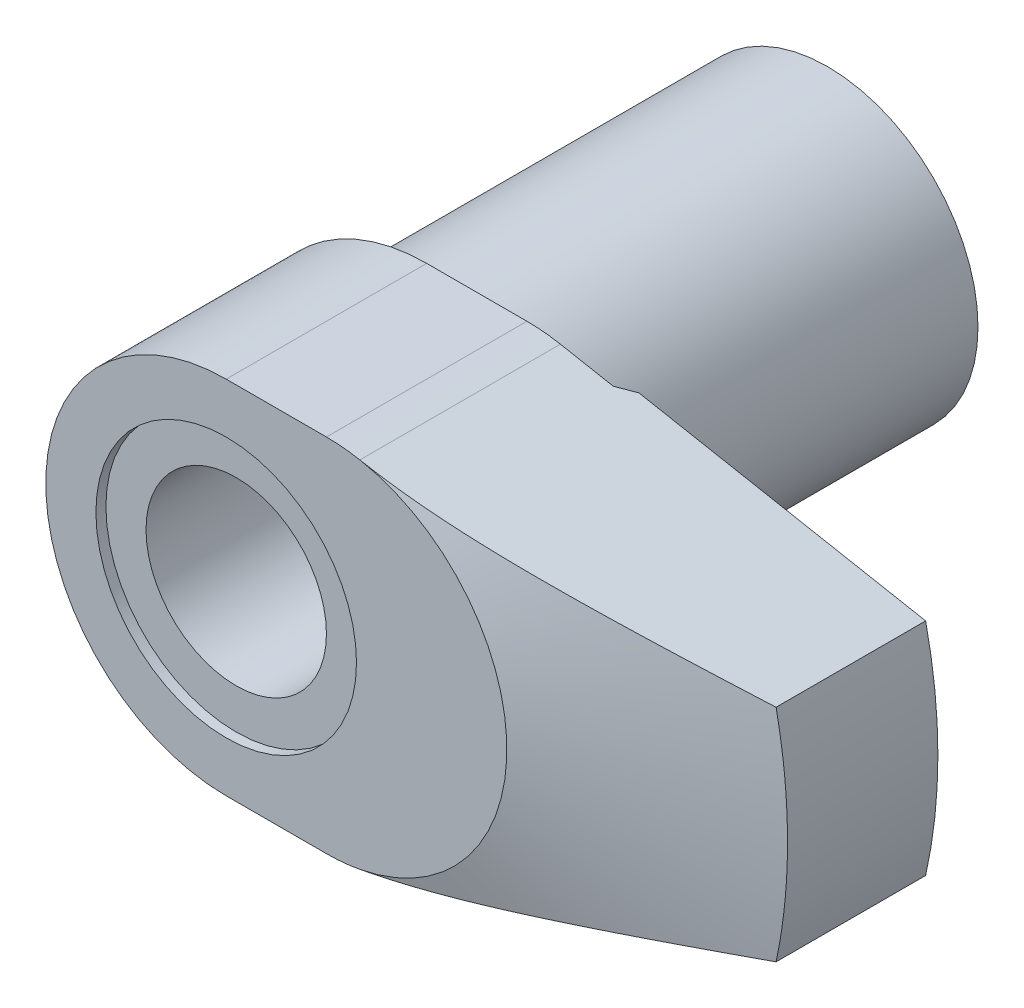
ISO-10303-21;
HEADER;
FILE_DESCRIPTION(('STEP AP214'),'2;1');
FILE_NAME('part.step','',(''),(''),'','','');
FILE_SCHEMA(('AUTOMOTIVE_DESIGN { 1 0 10303 214 1 1 1 1 }'));
ENDSEC;
DATA;
#1=APPLICATION_CONTEXT('core data for automotive mechanical design processes');
#2=APPLICATION_PROTOCOL_DEFINITION('international standard','automotive_design',2000,#1);
#3=PRODUCT_CONTEXT('',#1,'mechanical');
#4=PRODUCT('Part','Part','',(#3));
#5=PRODUCT_RELATED_PRODUCT_CATEGORY('part','',(#4));
#6=PRODUCT_DEFINITION_FORMATION('','',#4);
#7=PRODUCT_DEFINITION_CONTEXT('part definition',#1,'design');
#8=PRODUCT_DEFINITION('design','',#6,#7);
#9=PRODUCT_DEFINITION_SHAPE('','',#8);
#10=(LENGTH_UNIT() NAMED_UNIT(*) SI_UNIT(.MILLI.,.METRE.));
#11=(NAMED_UNIT(*) PLANE_ANGLE_UNIT() SI_UNIT($,.RADIAN.));
#12=(NAMED_UNIT(*) SI_UNIT($,.STERADIAN.) SOLID_ANGLE_UNIT());
#13=UNCERTAINTY_MEASURE_WITH_UNIT(LENGTH_MEASURE(1.E-05),#10,'distance_accuracy_value','');
#14=(GEOMETRIC_REPRESENTATION_CONTEXT(3) GLOBAL_UNCERTAINTY_ASSIGNED_CONTEXT((#13)) GLOBAL_UNIT_ASSIGNED_CONTEXT((#10,
#11,#12)) REPRESENTATION_CONTEXT('',''));
#15=CARTESIAN_POINT('',(0.,0.,0.));
#16=DIRECTION('',(0.,0.,1.));
#17=DIRECTION('',(1.,0.,0.));
#18=AXIS2_PLACEMENT_3D('',#15,#16,#17);
#19=CARTESIAN_POINT('',(10.,0.,39.));
#20=DIRECTION('',(0.,0.,1.));
#21=DIRECTION('',(1.,0.,0.));
#22=AXIS2_PLACEMENT_3D('',#19,#20,#21);
#23=CYLINDRICAL_SURFACE('',#22,18.);
#24=DIRECTION('',(0.,0.,1.));
#25=VECTOR('',#24,1.);
#26=CARTESIAN_POINT('',(10.,-18.,39.));
#27=LINE('',#26,#25);
#28=CARTESIAN_POINT('',(10.,-18.,40.));
#29=VERTEX_POINT('',#28);
#30=CARTESIAN_POINT('',(10.,-18.,60.));
#31=VERTEX_POINT('',#30);
#32=EDGE_CURVE('E143',#29,#31,#27,.T.);
#33=ORIENTED_EDGE('',*,*,#32,.F.);
#34=CARTESIAN_POINT('',(10.,0.,40.));
#35=DIRECTION('',(0.,0.,-1.));
#36=DIRECTION('',(-1.,0.,0.));
#37=AXIS2_PLACEMENT_3D('',#34,#35,#36);
#38=CIRCLE('',#37,18.);
#39=CARTESIAN_POINT('',(13.3380934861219,-17.6877678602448,40.));
#40=VERTEX_POINT('',#39);
#41=EDGE_CURVE('E120',#40,#29,#38,.T.);
#42=ORIENTED_EDGE('',*,*,#41,.F.);
#43=DIRECTION('',(0.,0.,1.));
#44=VECTOR('',#43,1.);
#45=CARTESIAN_POINT('',(13.3380934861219,-17.6877678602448,39.));
#46=LINE('',#45,#44);
#47=CARTESIAN_POINT('',(13.3380934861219,-17.6877678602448,60.));
#48=VERTEX_POINT('',#47);
#49=EDGE_CURVE('E110',#40,#48,#46,.T.);
#50=ORIENTED_EDGE('',*,*,#49,.T.);
#51=CARTESIAN_POINT('',(10.,0.,60.));
#52=DIRECTION('',(0.,0.,1.));
#53=DIRECTION('',(1.,0.,0.));
#54=AXIS2_PLACEMENT_3D('',#51,#52,#53);
#55=CIRCLE('',#54,18.);
#56=EDGE_CURVE('E118',#31,#48,#55,.T.);
#57=ORIENTED_EDGE('',*,*,#56,.F.);
#58=EDGE_LOOP('',(#33,#42,#50,#57));
#59=FACE_BOUND('',#58,.T.);
#60=ADVANCED_FACE('F14',(#59),#23,.T.);
#61=CARTESIAN_POINT('',(1.88540101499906E-13,-18.,39.));
#62=DIRECTION('',(0.,-1.,0.));
#63=DIRECTION('',(1.,0.,0.));
#64=AXIS2_PLACEMENT_3D('',#61,#62,#63);
#65=PLANE('',#64);
#66=DIRECTION('',(0.,0.,1.));
#67=VECTOR('',#66,1.);
#68=CARTESIAN_POINT('',(1.88540101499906E-13,-18.,39.));
#69=LINE('',#68,#67);
#70=CARTESIAN_POINT('',(0.,-18.,40.));
#71=VERTEX_POINT('',#70);
#72=CARTESIAN_POINT('',(0.,-18.,60.));
#73=VERTEX_POINT('',#72);
#74=EDGE_CURVE('E146',#71,#73,#69,.T.);
#75=ORIENTED_EDGE('',*,*,#74,.F.);
#76=DIRECTION('',(-1.,0.,0.));
#77=VECTOR('',#76,1.);
#78=CARTESIAN_POINT('',(10.,-18.,40.));
#79=LINE('',#78,#77);
#80=EDGE_CURVE('E233',#29,#71,#79,.T.);
#81=ORIENTED_EDGE('',*,*,#80,.F.);
#82=ORIENTED_EDGE('',*,*,#32,.T.);
#83=DIRECTION('',(1.,0.,0.));
#84=VECTOR('',#83,1.);
#85=CARTESIAN_POINT('',(1.88540101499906E-13,-18.,60.));
#86=LINE('',#85,#84);
#87=EDGE_CURVE('E127',#73,#31,#86,.T.);
#88=ORIENTED_EDGE('',*,*,#87,.F.);
#89=EDGE_LOOP('',(#75,#81,#82,#88));
#90=FACE_BOUND('',#89,.T.);
#91=ADVANCED_FACE('F267',(#90),#65,.T.);
#92=CARTESIAN_POINT('',(10.,18.,39.));
#93=DIRECTION('',(0.,1.,0.));
#94=DIRECTION('',(-1.,0.,0.));
#95=AXIS2_PLACEMENT_3D('',#92,#93,#94);
#96=PLANE('',#95);
#97=DIRECTION('',(0.,0.,1.));
#98=VECTOR('',#97,1.);
#99=CARTESIAN_POINT('',(10.,18.,39.));
#100=LINE('',#99,#98);
#101=CARTESIAN_POINT('',(10.,18.,40.));
#102=VERTEX_POINT('',#101);
#103=CARTESIAN_POINT('',(10.,18.,60.));
#104=VERTEX_POINT('',#103);
#105=EDGE_CURVE('E150',#102,#104,#100,.T.);
#106=ORIENTED_EDGE('',*,*,#105,.F.);
#107=DIRECTION('',(1.,0.,0.));
#108=VECTOR('',#107,1.);
#109=CARTESIAN_POINT('',(0.,18.,40.));
#110=LINE('',#109,#108);
#111=CARTESIAN_POINT('',(0.,18.,40.));
#112=VERTEX_POINT('',#111);
#113=EDGE_CURVE('E235',#112,#102,#110,.T.);
#114=ORIENTED_EDGE('',*,*,#113,.F.);
#115=DIRECTION('',(0.,0.,1.));
#116=VECTOR('',#115,1.);
#117=CARTESIAN_POINT('',(0.,18.,39.));
#118=LINE('',#117,#116);
#119=CARTESIAN_POINT('',(0.,18.,60.));
#120=VERTEX_POINT('',#119);
#121=EDGE_CURVE('E148',#112,#120,#118,.T.);
#122=ORIENTED_EDGE('',*,*,#121,.T.);
#123=DIRECTION('',(-1.,0.,0.));
#124=VECTOR('',#123,1.);
#125=CARTESIAN_POINT('',(10.,18.,60.));
#126=LINE('',#125,#124);
#127=EDGE_CURVE('E131',#104,#120,#126,.T.);
#128=ORIENTED_EDGE('',*,*,#127,.F.);
#129=EDGE_LOOP('',(#106,#114,#122,#128));
#130=FACE_BOUND('',#129,.T.);
#131=ADVANCED_FACE('F272',(#130),#96,.T.);
#132=CARTESIAN_POINT('',(10.,0.,39.));
#133=DIRECTION('',(0.,0.,1.));
#134=DIRECTION('',(1.,0.,0.));
#135=AXIS2_PLACEMENT_3D('',#132,#133,#134);
#136=CYLINDRICAL_SURFACE('',#135,18.);
#137=DIRECTION('',(0.,0.,1.));
#138=VECTOR('',#137,1.);
#139=CARTESIAN_POINT('',(13.3380934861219,17.6877678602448,39.));
#140=LINE('',#139,#138);
#141=CARTESIAN_POINT('',(13.3380934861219,17.6877678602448,40.));
#142=VERTEX_POINT('',#141);
#143=CARTESIAN_POINT('',(13.3380934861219,17.6877678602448,60.));
#144=VERTEX_POINT('',#143);
#145=EDGE_CURVE('E152',#142,#144,#140,.T.);
#146=ORIENTED_EDGE('',*,*,#145,.F.);
#147=CARTESIAN_POINT('',(10.,0.,40.));
#148=DIRECTION('',(0.,0.,-1.));
#149=DIRECTION('',(-1.,0.,0.));
#150=AXIS2_PLACEMENT_3D('',#147,#148,#149);
#151=CIRCLE('',#150,18.);
#152=EDGE_CURVE('E222',#102,#142,#151,.T.);
#153=ORIENTED_EDGE('',*,*,#152,.F.);
#154=ORIENTED_EDGE('',*,*,#105,.T.);
#155=CARTESIAN_POINT('',(10.,0.,60.));
#156=DIRECTION('',(0.,0.,1.));
#157=DIRECTION('',(1.,0.,0.));
#158=AXIS2_PLACEMENT_3D('',#155,#156,#157);
#159=CIRCLE('',#158,18.);
#160=EDGE_CURVE('E128',#144,#104,#159,.T.);
#161=ORIENTED_EDGE('',*,*,#160,.F.);
#162=EDGE_LOOP('',(#146,#153,#154,#161));
#163=FACE_BOUND('',#162,.T.);
#164=ADVANCED_FACE('F210',(#163),#136,.T.);
#165=CARTESIAN_POINT('',(48.7749935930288,11.,39.));
#166=DIRECTION('',(0.185449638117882,0.982653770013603,0.));
#167=DIRECTION('',(-0.982653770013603,0.185449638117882,0.));
#168=AXIS2_PLACEMENT_3D('',#165,#166,#167);
#169=PLANE('',#168);
#170=CARTESIAN_POINT('',(48.7751935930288,10.9999622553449,53.9167444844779));
#171=CARTESIAN_POINT('',(48.0465361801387,11.1374768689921,54.0976756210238));
#172=CARTESIAN_POINT('',(47.3176316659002,11.2750381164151,54.2775823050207));
#173=CARTESIAN_POINT('',(45.8592364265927,11.5502712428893,54.6349399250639));
#174=CARTESIAN_POINT('',(45.1297456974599,11.6879431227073,54.8123908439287));
#175=CARTESIAN_POINT('',(43.670157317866,11.9634014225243,55.1644128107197));
#176=CARTESIAN_POINT('',(42.9400597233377,12.1011878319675,55.3389840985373));
#177=CARTESIAN_POINT('',(41.4790904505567,12.3769067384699,55.6847383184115));
#178=CARTESIAN_POINT('',(40.7482187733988,12.5148392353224,55.855921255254));
#179=CARTESIAN_POINT('',(39.2877585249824,12.7904620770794,56.1937556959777));
#180=CARTESIAN_POINT('',(38.5581726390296,12.9281519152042,56.3604192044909));
#181=CARTESIAN_POINT('',(37.0979614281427,13.2037277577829,56.6889595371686));
#182=CARTESIAN_POINT('',(36.3673361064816,13.3416137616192,56.8508363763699));
#183=CARTESIAN_POINT('',(34.9047280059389,13.6176419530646,57.1688639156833));
#184=CARTESIAN_POINT('',(34.1727449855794,13.7557841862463,57.3250134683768));
#185=CARTESIAN_POINT('',(32.70737170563,14.0323342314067,57.630345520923));
#186=CARTESIAN_POINT('',(31.9739814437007,14.1707420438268,57.7795280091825));
#187=CARTESIAN_POINT('',(30.5028244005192,14.4483836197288,58.0699756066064));
#188=CARTESIAN_POINT('',(29.7650515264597,14.5876185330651,58.2112088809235));
#189=CARTESIAN_POINT('',(28.2876513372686,14.8664383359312,58.4832933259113));
#190=CARTESIAN_POINT('',(27.5480240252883,15.0060232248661,58.614144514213));
#191=CARTESIAN_POINT('',(26.0670755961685,15.2855126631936,58.8631596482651));
#192=CARTESIAN_POINT('',(25.3257555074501,15.4254170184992,58.9813298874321));
#193=CARTESIAN_POINT('',(23.8408933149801,15.7056450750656,59.2024316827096));
#194=CARTESIAN_POINT('',(23.0973511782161,15.8459687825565,59.3053630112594));
#195=CARTESIAN_POINT('',(21.6057597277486,16.1274668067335,59.4933400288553));
#196=CARTESIAN_POINT('',(20.8577035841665,16.2686424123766,59.5783300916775));
#197=CARTESIAN_POINT('',(19.3595596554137,16.551377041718,59.7269620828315));
#198=CARTESIAN_POINT('',(18.6094720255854,16.6929360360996,59.7906055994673));
#199=CARTESIAN_POINT('',(17.4824925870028,16.9056232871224,59.8680607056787));
#200=CARTESIAN_POINT('',(17.1061863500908,16.9766410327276,59.8908897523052));
#201=CARTESIAN_POINT('',(16.3532535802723,17.1187369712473,59.9302421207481));
#202=CARTESIAN_POINT('',(15.9766270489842,17.1898151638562,59.9467654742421));
#203=CARTESIAN_POINT('',(15.223044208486,17.3320337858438,59.9732922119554));
#204=CARTESIAN_POINT('',(14.8460878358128,17.4031742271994,59.9832937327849));
#205=CARTESIAN_POINT('',(14.0920528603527,17.5454781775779,59.9966560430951));
#206=CARTESIAN_POINT('',(13.7149742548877,17.6166416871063,60.0000166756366));
#207=CARTESIAN_POINT('',(13.3378934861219,17.6878056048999,59.9999999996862));
#208=B_SPLINE_CURVE_WITH_KNOTS('',3,(#170,#171,#172,#173,#174,#175,#176,#177,#178,#179,#180,
#181,#182,#183,#184,#185,#186,#187,#188,#189,#190,#191,#192,#193,#194,#195,#196,#197,#198,#199,
#200,#201,#202,#203,#204,#205,#206,#207),.UNSPECIFIED.,.F.,.F.,(4,2,2,2,2,2,2,2,2,2,2,2,2,2,2,2,
2,2,4),(0.,2.28982495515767,4.57966592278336,6.86931515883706,9.15896116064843,11.4417702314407,
13.7245721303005,16.0078289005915,18.2910894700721,20.5829240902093,22.874754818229,
25.165442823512,27.456165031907,29.7538884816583,32.0514409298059,33.2022839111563,
34.3531211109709,35.5042869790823,36.6554800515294),.UNSPECIFIED.);
#209=CARTESIAN_POINT('',(48.7749935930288,11.,53.9167941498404));
#210=VERTEX_POINT('',#209);
#211=EDGE_CURVE('E98',#210,#144,#208,.T.);
#212=ORIENTED_EDGE('',*,*,#211,.F.);
#213=DIRECTION('',(0.,0.,1.));
#214=VECTOR('',#213,1.);
#215=CARTESIAN_POINT('',(48.7749935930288,11.,39.));
#216=LINE('',#215,#214);
#217=CARTESIAN_POINT('',(48.7749935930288,11.,39.));
#218=VERTEX_POINT('',#217);
#219=EDGE_CURVE('E154',#218,#210,#216,.T.);
#220=ORIENTED_EDGE('',*,*,#219,.F.);
#221=DIRECTION('',(-0.982653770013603,0.185449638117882,0.));
#222=VECTOR('',#221,1.);
#223=CARTESIAN_POINT('',(48.7749935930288,11.,39.));
#224=LINE('',#223,#222);
#225=CARTESIAN_POINT('',(20.1776893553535,16.3969769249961,39.));
#226=VERTEX_POINT('',#225);
#227=EDGE_CURVE('E121',#218,#226,#224,.T.);
#228=ORIENTED_EDGE('',*,*,#227,.T.);
#229=CARTESIAN_POINT('',(18.6102300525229,16.692792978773,40.0002));
#230=CARTESIAN_POINT('',(18.742019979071,16.6679211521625,39.9187004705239));
#231=CARTESIAN_POINT('',(18.873513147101,16.6431053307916,39.8367046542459));
#232=CARTESIAN_POINT('',(19.135917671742,16.5935834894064,39.6717681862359));
#233=CARTESIAN_POINT('',(19.266829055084,16.5688774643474,39.588827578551));
#234=CARTESIAN_POINT('',(19.5280935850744,16.5195707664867,39.4220419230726));
#235=CARTESIAN_POINT('',(19.658446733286,16.49497009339,39.338196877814));
#236=CARTESIAN_POINT('',(19.9186184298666,16.4458696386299,39.1696385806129));
#237=CARTESIAN_POINT('',(20.0484369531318,16.4213698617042,39.0849252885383));
#238=CARTESIAN_POINT('',(20.1779937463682,16.3969194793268,38.9998));
#239=B_SPLINE_CURVE_WITH_KNOTS('',3,(#229,#230,#231,#232,#233,#234,#235,#236,#237,#238),
.UNSPECIFIED.,.F.,.F.,(4,2,2,2,4),(0.,0.470810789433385,0.941599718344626,1.41238732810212,
1.88319679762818),.UNSPECIFIED.);
#240=CARTESIAN_POINT('',(18.6105534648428,16.6927319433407,40.));
#241=VERTEX_POINT('',#240);
#242=EDGE_CURVE('E196',#241,#226,#239,.T.);
#243=ORIENTED_EDGE('',*,*,#242,.F.);
#244=DIRECTION('',(0.982653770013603,-0.185449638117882,0.));
#245=VECTOR('',#244,1.);
#246=CARTESIAN_POINT('',(13.3380934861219,17.6877678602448,40.));
#247=LINE('',#246,#245);
#248=EDGE_CURVE('E228',#142,#241,#247,.T.);
#249=ORIENTED_EDGE('',*,*,#248,.F.);
#250=ORIENTED_EDGE('',*,*,#145,.T.);
#251=EDGE_LOOP('',(#212,#220,#228,#243,#249,#250));
#252=FACE_BOUND('',#251,.T.);
#253=ADVANCED_FACE('F206',(#252),#169,.T.);
#254=CARTESIAN_POINT('',(48.7749935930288,-11.,39.));
#255=DIRECTION('',(0.185449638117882,-0.982653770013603,0.));
#256=DIRECTION('',(0.982653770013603,0.185449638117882,0.));
#257=AXIS2_PLACEMENT_3D('',#254,#255,#256);
#258=PLANE('',#257);
#259=CARTESIAN_POINT('',(13.3378934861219,-17.6878056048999,59.9999999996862));
#260=CARTESIAN_POINT('',(13.7171760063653,-17.6162261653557,60.0000170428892));
#261=CARTESIAN_POINT('',(14.0964563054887,-17.5446471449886,59.9966168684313));
#262=CARTESIAN_POINT('',(14.8548924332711,-17.401512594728,59.9830983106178));
#263=CARTESIAN_POINT('',(15.2340482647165,-17.3299570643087,59.9729800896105));
#264=CARTESIAN_POINT('',(15.9920234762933,-17.1869094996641,59.9461455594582));
#265=CARTESIAN_POINT('',(16.3708429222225,-17.1154174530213,59.9294311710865));
#266=CARTESIAN_POINT('',(17.1281561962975,-16.9724948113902,59.8896272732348));
#267=CARTESIAN_POINT('',(17.5066500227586,-16.9010642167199,59.8665377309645));
#268=CARTESIAN_POINT('',(18.6401621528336,-16.6871440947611,59.7882077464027));
#269=CARTESIAN_POINT('',(19.3945854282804,-16.5447668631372,59.7238553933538));
#270=CARTESIAN_POINT('',(20.9013719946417,-16.2604011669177,59.5736091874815));
#271=CARTESIAN_POINT('',(21.6537351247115,-16.1184127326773,59.4877136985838));
#272=CARTESIAN_POINT('',(23.1538953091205,-15.8352975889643,59.2977882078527));
#273=CARTESIAN_POINT('',(23.9016992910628,-15.6941695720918,59.1938143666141));
#274=CARTESIAN_POINT('',(25.3950618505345,-15.4123372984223,58.9705329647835));
#275=CARTESIAN_POINT('',(26.1406204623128,-15.2716330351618,58.8512256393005));
#276=CARTESIAN_POINT('',(27.6300337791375,-14.9905460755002,58.5998747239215));
#277=CARTESIAN_POINT('',(28.3738874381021,-14.8501635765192,58.4678247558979));
#278=CARTESIAN_POINT('',(29.8597278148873,-14.5697509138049,58.1933062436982));
#279=CARTESIAN_POINT('',(30.601714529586,-14.4297207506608,58.0508376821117));
#280=CARTESIAN_POINT('',(32.0727292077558,-14.1521060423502,57.7595953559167));
#281=CARTESIAN_POINT('',(32.801782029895,-14.0145168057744,57.6109511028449));
#282=CARTESIAN_POINT('',(34.2585048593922,-13.7395993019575,57.3068302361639));
#283=CARTESIAN_POINT('',(34.9861748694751,-13.6022710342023,57.1513536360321));
#284=CARTESIAN_POINT('',(36.4401757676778,-13.327867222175,56.8347765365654));
#285=CARTESIAN_POINT('',(37.1665068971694,-13.1907916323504,56.6736771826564));
#286=CARTESIAN_POINT('',(38.6181463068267,-12.9168334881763,56.3467724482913));
#287=CARTESIAN_POINT('',(39.3434545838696,-12.7799509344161,56.1809670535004));
#288=CARTESIAN_POINT('',(40.7953350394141,-12.5059472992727,55.844920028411));
#289=CARTESIAN_POINT('',(41.5219046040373,-12.3688267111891,55.674666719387));
#290=CARTESIAN_POINT('',(42.9742806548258,-12.0947295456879,55.3308212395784));
#291=CARTESIAN_POINT('',(43.7000871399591,-11.957752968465,55.1572290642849));
#292=CARTESIAN_POINT('',(45.1511071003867,-11.6839117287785,54.807202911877));
#293=CARTESIAN_POINT('',(45.876320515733,-11.5470470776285,54.6307686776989));
#294=CARTESIAN_POINT('',(47.3261685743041,-11.2734270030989,54.2754753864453));
#295=CARTESIAN_POINT('',(48.0508032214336,-11.1366715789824,54.0966163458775));
#296=CARTESIAN_POINT('',(48.7751935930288,-10.9999622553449,53.9167444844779));
#297=B_SPLINE_CURVE_WITH_KNOTS('',3,(#259,#260,#261,#262,#263,#264,#265,#266,#267,#268,#269,
#270,#271,#272,#273,#274,#275,#276,#277,#278,#279,#280,#281,#282,#283,#284,#285,#286,#287,#288,
#289,#290,#291,#292,#293,#294,#295,#296),.UNSPECIFIED.,.F.,.F.,(4,2,2,2,2,2,2,2,2,2,2,2,2,2,2,2,
2,2,4),(0.,1.15791456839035,2.31580115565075,3.47335082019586,4.63090643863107,6.94182118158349,
9.25291147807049,11.5569465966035,13.8609463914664,16.1661054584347,18.4712683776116,
20.7412290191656,23.0111851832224,25.280681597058,27.5501849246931,29.8264061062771,
32.1026303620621,34.3790616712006,36.6554774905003),.UNSPECIFIED.);
#298=CARTESIAN_POINT('',(48.7749935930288,-11.,53.9167941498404));
#299=VERTEX_POINT('',#298);
#300=EDGE_CURVE('E34',#48,#299,#297,.T.);
#301=ORIENTED_EDGE('',*,*,#300,.F.);
#302=ORIENTED_EDGE('',*,*,#49,.F.);
#303=DIRECTION('',(-0.982653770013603,-0.185449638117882,0.));
#304=VECTOR('',#303,1.);
#305=CARTESIAN_POINT('',(18.6105534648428,-16.6927319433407,40.));
#306=LINE('',#305,#304);
#307=CARTESIAN_POINT('',(18.6105534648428,-16.6927319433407,40.));
#308=VERTEX_POINT('',#307);
#309=EDGE_CURVE('E230',#308,#40,#306,.T.);
#310=ORIENTED_EDGE('',*,*,#309,.F.);
#311=CARTESIAN_POINT('',(20.1779937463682,-16.3969194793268,38.9998));
#312=CARTESIAN_POINT('',(20.0484369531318,-16.4213698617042,39.0849252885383));
#313=CARTESIAN_POINT('',(19.9186184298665,-16.4458696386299,39.1696385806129));
#314=CARTESIAN_POINT('',(19.658446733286,-16.49497009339,39.338196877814));
#315=CARTESIAN_POINT('',(19.5280935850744,-16.5195707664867,39.4220419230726));
#316=CARTESIAN_POINT('',(19.266829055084,-16.5688774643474,39.588827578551));
#317=CARTESIAN_POINT('',(19.135917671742,-16.5935834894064,39.6717681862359));
#318=CARTESIAN_POINT('',(18.873513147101,-16.6431053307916,39.8367046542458));
#319=CARTESIAN_POINT('',(18.742019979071,-16.6679211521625,39.9187004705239));
#320=CARTESIAN_POINT('',(18.6102300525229,-16.692792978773,40.0002));
#321=B_SPLINE_CURVE_WITH_KNOTS('',3,(#311,#312,#313,#314,#315,#316,#317,#318,#319,#320),
.UNSPECIFIED.,.F.,.F.,(4,2,2,2,4),(0.,0.470809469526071,0.941597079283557,1.4123860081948,
1.88319679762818),.UNSPECIFIED.);
#322=CARTESIAN_POINT('',(20.1776893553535,-16.3969769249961,39.));
#323=VERTEX_POINT('',#322);
#324=EDGE_CURVE('E28',#323,#308,#321,.T.);
#325=ORIENTED_EDGE('',*,*,#324,.F.);
#326=DIRECTION('',(0.982653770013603,0.185449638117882,0.));
#327=VECTOR('',#326,1.);
#328=CARTESIAN_POINT('',(48.7749935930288,-11.,39.));
#329=LINE('',#328,#327);
#330=CARTESIAN_POINT('',(48.7749935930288,-11.,39.));
#331=VERTEX_POINT('',#330);
#332=EDGE_CURVE('E142',#323,#331,#329,.T.);
#333=ORIENTED_EDGE('',*,*,#332,.T.);
#334=DIRECTION('',(0.,0.,1.));
#335=VECTOR('',#334,1.);
#336=CARTESIAN_POINT('',(48.7749935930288,-11.,39.));
#337=LINE('',#336,#335);
#338=EDGE_CURVE('E112',#331,#299,#337,.T.);
#339=ORIENTED_EDGE('',*,*,#338,.T.);
#340=EDGE_LOOP('',(#301,#302,#310,#325,#333,#339));
#341=FACE_BOUND('',#340,.T.);
#342=ADVANCED_FACE('F108',(#341),#258,.T.);
#343=CARTESIAN_POINT('',(0.,0.,60.));
#344=DIRECTION('',(0.,0.,-1.));
#345=DIRECTION('',(-1.,0.,0.));
#346=AXIS2_PLACEMENT_3D('',#343,#344,#345);
#347=CYLINDRICAL_SURFACE('',#346,18.);
#348=CARTESIAN_POINT('',(0.,0.,40.));
#349=DIRECTION('',(0.,0.,1.));
#350=DIRECTION('',(1.,0.,0.));
#351=AXIS2_PLACEMENT_3D('',#348,#349,#350);
#352=CIRCLE('',#351,18.);
#353=EDGE_CURVE('E134',#112,#71,#352,.T.);
#354=ORIENTED_EDGE('',*,*,#353,.T.);
#355=ORIENTED_EDGE('',*,*,#74,.T.);
#356=CARTESIAN_POINT('',(0.,0.,60.));
#357=DIRECTION('',(0.,0.,1.));
#358=DIRECTION('',(1.,0.,0.));
#359=AXIS2_PLACEMENT_3D('',#356,#357,#358);
#360=CIRCLE('',#359,18.);
#361=EDGE_CURVE('E176',#120,#73,#360,.T.);
#362=ORIENTED_EDGE('',*,*,#361,.F.);
#363=ORIENTED_EDGE('',*,*,#121,.F.);
#364=EDGE_LOOP('',(#354,#355,#362,#363));
#365=FACE_BOUND('',#364,.T.);
#366=ADVANCED_FACE('F16',(#365),#347,.T.);
#367=CARTESIAN_POINT('',(60.,20.,39.));
#368=DIRECTION('',(0.,0.,1.));
#369=DIRECTION('',(1.,0.,0.));
#370=AXIS2_PLACEMENT_3D('',#367,#368,#369);
#371=PLANE('',#370);
#372=ORIENTED_EDGE('',*,*,#332,.F.);
#373=CARTESIAN_POINT('',(0.,0.,39.));
#374=DIRECTION('',(0.,0.,1.));
#375=DIRECTION('',(1.,0.,0.));
#376=AXIS2_PLACEMENT_3D('',#373,#374,#375);
#377=CIRCLE('',#376,26.);
#378=EDGE_CURVE('E42',#323,#226,#377,.T.);
#379=ORIENTED_EDGE('',*,*,#378,.T.);
#380=ORIENTED_EDGE('',*,*,#227,.F.);
#381=CARTESIAN_POINT('',(0.,0.,39.));
#382=DIRECTION('',(0.,0.,1.));
#383=DIRECTION('',(1.,0.,0.));
#384=AXIS2_PLACEMENT_3D('',#381,#382,#383);
#385=CIRCLE('',#384,50.);
#386=EDGE_CURVE('E247',#331,#218,#385,.T.);
#387=ORIENTED_EDGE('',*,*,#386,.F.);
#388=EDGE_LOOP('',(#372,#379,#380,#387));
#389=FACE_BOUND('',#388,.T.);
#390=ADVANCED_FACE('F250',(#389),#371,.F.);
#391=CARTESIAN_POINT('',(0.,0.,0.));
#392=DIRECTION('',(0.,0.,-1.));
#393=DIRECTION('',(-1.,0.,0.));
#394=AXIS2_PLACEMENT_3D('',#391,#392,#393);
#395=CYLINDRICAL_SURFACE('',#394,9.);
#396=CARTESIAN_POINT('',(0.,0.,34.));
#397=DIRECTION('',(0.,0.,-1.));
#398=DIRECTION('',(-1.,0.,0.));
#399=AXIS2_PLACEMENT_3D('',#396,#397,#398);
#400=CIRCLE('',#399,9.);
#401=CARTESIAN_POINT('',(-9.,0.,34.));
#402=VERTEX_POINT('',#401);
#403=EDGE_CURVE('E170',#402,#402,#400,.T.);
#404=ORIENTED_EDGE('',*,*,#403,.T.);
#405=EDGE_LOOP('',(#404));
#406=FACE_BOUND('',#405,.T.);
#407=CARTESIAN_POINT('',(0.,0.,59.));
#408=DIRECTION('',(0.,0.,1.));
#409=DIRECTION('',(1.,0.,0.));
#410=AXIS2_PLACEMENT_3D('',#407,#408,#409);
#411=CIRCLE('',#410,9.);
#412=CARTESIAN_POINT('',(9.,0.,59.));
#413=VERTEX_POINT('',#412);
#414=EDGE_CURVE('E161',#413,#413,#411,.T.);
#415=ORIENTED_EDGE('',*,*,#414,.T.);
#416=EDGE_LOOP('',(#415));
#417=FACE_BOUND('',#416,.T.);
#418=ADVANCED_FACE('F252',(#406,#417),#395,.F.);
#419=CARTESIAN_POINT('',(0.,0.,0.));
#420=DIRECTION('',(0.,0.,1.));
#421=DIRECTION('',(1.,0.,0.));
#422=AXIS2_PLACEMENT_3D('',#419,#420,#421);
#423=PLANE('',#422);
#424=CARTESIAN_POINT('',(0.,0.,0.));
#425=DIRECTION('',(0.,0.,-1.));
#426=DIRECTION('',(-1.,0.,0.));
#427=AXIS2_PLACEMENT_3D('',#424,#425,#426);
#428=CIRCLE('',#427,15.);
#429=CARTESIAN_POINT('',(-15.,0.,0.));
#430=VERTEX_POINT('',#429);
#431=EDGE_CURVE('E173',#430,#430,#428,.T.);
#432=ORIENTED_EDGE('',*,*,#431,.T.);
#433=EDGE_LOOP('',(#432));
#434=FACE_BOUND('',#433,.T.);
#435=CARTESIAN_POINT('',(0.,0.,0.));
#436=DIRECTION('',(0.,0.,-1.));
#437=DIRECTION('',(-1.,0.,0.));
#438=AXIS2_PLACEMENT_3D('',#435,#436,#437);
#439=CIRCLE('',#438,11.5);
#440=CARTESIAN_POINT('',(-11.5,0.,0.));
#441=VERTEX_POINT('',#440);
#442=EDGE_CURVE('E164',#441,#441,#439,.T.);
#443=ORIENTED_EDGE('',*,*,#442,.F.);
#444=EDGE_LOOP('',(#443));
#445=FACE_BOUND('',#444,.T.);
#446=ADVANCED_FACE('F260',(#434,#445),#423,.F.);
#447=CARTESIAN_POINT('',(0.,0.,60.));
#448=DIRECTION('',(0.,0.,1.));
#449=DIRECTION('',(1.,0.,0.));
#450=AXIS2_PLACEMENT_3D('',#447,#448,#449);
#451=PLANE('',#450);
#452=CARTESIAN_POINT('',(10.,0.,60.));
#453=DIRECTION('',(0.,0.,1.));
#454=DIRECTION('',(1.,0.,0.));
#455=AXIS2_PLACEMENT_3D('',#452,#453,#454);
#456=CIRCLE('',#455,18.);
#457=EDGE_CURVE('E95',#48,#144,#456,.T.);
#458=ORIENTED_EDGE('',*,*,#457,.T.);
#459=ORIENTED_EDGE('',*,*,#160,.T.);
#460=ORIENTED_EDGE('',*,*,#127,.T.);
#461=ORIENTED_EDGE('',*,*,#361,.T.);
#462=ORIENTED_EDGE('',*,*,#87,.T.);
#463=ORIENTED_EDGE('',*,*,#56,.T.);
#464=EDGE_LOOP('',(#458,#459,#460,#461,#462,#463));
#465=FACE_BOUND('',#464,.T.);
#466=CARTESIAN_POINT('',(0.,0.,60.));
#467=DIRECTION('',(0.,0.,1.));
#468=DIRECTION('',(1.,0.,0.));
#469=AXIS2_PLACEMENT_3D('',#466,#467,#468);
#470=CIRCLE('',#469,13.);
#471=CARTESIAN_POINT('',(13.,0.,60.));
#472=VERTEX_POINT('',#471);
#473=EDGE_CURVE('E145',#472,#472,#470,.T.);
#474=ORIENTED_EDGE('',*,*,#473,.F.);
#475=EDGE_LOOP('',(#474));
#476=FACE_BOUND('',#475,.T.);
#477=ADVANCED_FACE('F123',(#465,#476),#451,.T.);
#478=CARTESIAN_POINT('',(0.,0.,39.));
#479=DIRECTION('',(0.,0.,-1.));
#480=DIRECTION('',(-1.,0.,0.));
#481=AXIS2_PLACEMENT_3D('',#478,#479,#480);
#482=CYLINDRICAL_SURFACE('',#481,15.);
#483=ORIENTED_EDGE('',*,*,#431,.F.);
#484=EDGE_LOOP('',(#483));
#485=FACE_BOUND('',#484,.T.);
#486=CARTESIAN_POINT('',(0.,0.,40.));
#487=DIRECTION('',(0.,0.,1.));
#488=DIRECTION('',(1.,0.,0.));
#489=AXIS2_PLACEMENT_3D('',#486,#487,#488);
#490=CIRCLE('',#489,15.);
#491=CARTESIAN_POINT('',(15.,0.,40.));
#492=VERTEX_POINT('',#491);
#493=EDGE_CURVE('E129',#492,#492,#490,.T.);
#494=ORIENTED_EDGE('',*,*,#493,.F.);
#495=EDGE_LOOP('',(#494));
#496=FACE_BOUND('',#495,.T.);
#497=ADVANCED_FACE('F289',(#485,#496),#482,.T.);
#498=CARTESIAN_POINT('',(9.,0.,34.));
#499=DIRECTION('',(0.,0.,-1.));
#500=DIRECTION('',(-1.,0.,0.));
#501=AXIS2_PLACEMENT_3D('',#498,#499,#500);
#502=PLANE('',#501);
#503=CARTESIAN_POINT('',(0.,0.,34.));
#504=DIRECTION('',(0.,0.,-1.));
#505=DIRECTION('',(-1.,0.,0.));
#506=AXIS2_PLACEMENT_3D('',#503,#504,#505);
#507=CIRCLE('',#506,11.5);
#508=CARTESIAN_POINT('',(-11.5,0.,34.));
#509=VERTEX_POINT('',#508);
#510=EDGE_CURVE('E167',#509,#509,#507,.T.);
#511=ORIENTED_EDGE('',*,*,#510,.T.);
#512=EDGE_LOOP('',(#511));
#513=FACE_BOUND('',#512,.T.);
#514=ORIENTED_EDGE('',*,*,#403,.F.);
#515=EDGE_LOOP('',(#514));
#516=FACE_BOUND('',#515,.T.);
#517=ADVANCED_FACE('F286',(#513,#516),#502,.T.);
#518=CARTESIAN_POINT('',(0.,0.,0.));
#519=DIRECTION('',(0.,0.,-1.));
#520=DIRECTION('',(-1.,0.,0.));
#521=AXIS2_PLACEMENT_3D('',#518,#519,#520);
#522=CYLINDRICAL_SURFACE('',#521,11.5);
#523=ORIENTED_EDGE('',*,*,#442,.T.);
#524=EDGE_LOOP('',(#523));
#525=FACE_BOUND('',#524,.T.);
#526=ORIENTED_EDGE('',*,*,#510,.F.);
#527=EDGE_LOOP('',(#526));
#528=FACE_BOUND('',#527,.T.);
#529=ADVANCED_FACE('F282',(#525,#528),#522,.F.);
#530=CARTESIAN_POINT('',(0.,0.,59.));
#531=DIRECTION('',(0.,0.,1.));
#532=DIRECTION('',(1.,0.,0.));
#533=AXIS2_PLACEMENT_3D('',#530,#531,#532);
#534=CYLINDRICAL_SURFACE('',#533,13.);
#535=CARTESIAN_POINT('',(0.,0.,59.));
#536=DIRECTION('',(0.,0.,1.));
#537=DIRECTION('',(1.,0.,0.));
#538=AXIS2_PLACEMENT_3D('',#535,#536,#537);
#539=CIRCLE('',#538,13.);
#540=CARTESIAN_POINT('',(13.,0.,59.));
#541=VERTEX_POINT('',#540);
#542=EDGE_CURVE('E158',#541,#541,#539,.T.);
#543=ORIENTED_EDGE('',*,*,#542,.F.);
#544=EDGE_LOOP('',(#543));
#545=FACE_BOUND('',#544,.T.);
#546=ORIENTED_EDGE('',*,*,#473,.T.);
#547=EDGE_LOOP('',(#546));
#548=FACE_BOUND('',#547,.T.);
#549=ADVANCED_FACE('F278',(#545,#548),#534,.F.);
#550=CARTESIAN_POINT('',(0.,0.,59.));
#551=DIRECTION('',(0.,0.,1.));
#552=DIRECTION('',(1.,0.,0.));
#553=AXIS2_PLACEMENT_3D('',#550,#551,#552);
#554=PLANE('',#553);
#555=ORIENTED_EDGE('',*,*,#414,.F.);
#556=EDGE_LOOP('',(#555));
#557=FACE_BOUND('',#556,.T.);
#558=ORIENTED_EDGE('',*,*,#542,.T.);
#559=EDGE_LOOP('',(#558));
#560=FACE_BOUND('',#559,.T.);
#561=ADVANCED_FACE('F275',(#557,#560),#554,.T.);
#562=CARTESIAN_POINT('',(0.,0.,39.));
#563=DIRECTION('',(0.,0.,1.));
#564=DIRECTION('',(1.,0.,0.));
#565=AXIS2_PLACEMENT_3D('',#562,#563,#564);
#566=CYLINDRICAL_SURFACE('',#565,50.);
#567=CARTESIAN_POINT('',(48.7749484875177,-11.0002,53.9167910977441));
#568=CARTESIAN_POINT('',(48.9306309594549,-10.3099440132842,53.9273259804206));
#569=CARTESIAN_POINT('',(49.0716452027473,-9.6163707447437,53.9368824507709));
#570=CARTESIAN_POINT('',(49.324122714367,-8.22383261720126,53.9540108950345));
#571=CARTESIAN_POINT('',(49.4355856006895,-7.52486768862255,53.9615828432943));
#572=CARTESIAN_POINT('',(49.62878932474,-6.12246248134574,53.9747175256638));
#573=CARTESIAN_POINT('',(49.7105155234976,-5.41902017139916,53.9802792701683));
#574=CARTESIAN_POINT('',(49.8440224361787,-4.00933979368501,53.9893694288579));
#575=CARTESIAN_POINT('',(49.8958036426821,-3.3031017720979,53.9928978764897));
#576=CARTESIAN_POINT('',(50.0047161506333,-1.20802801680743,54.0003201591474));
#577=CARTESIAN_POINT('',(50.0189880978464,0.183269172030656,54.0012942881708));
#578=CARTESIAN_POINT('',(49.9315541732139,2.961424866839,53.9953338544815));
#579=CARTESIAN_POINT('',(49.8299183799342,4.34828554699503,53.9884040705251));
#580=CARTESIAN_POINT('',(49.6198783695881,6.16973049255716,53.9741128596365));
#581=CARTESIAN_POINT('',(49.5630560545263,6.61068793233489,53.9702481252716));
#582=CARTESIAN_POINT('',(49.4376820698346,7.49086697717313,53.9617264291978));
#583=CARTESIAN_POINT('',(49.3691325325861,7.9300888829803,53.9570696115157));
#584=CARTESIAN_POINT('',(49.2199027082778,8.80915057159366,53.9469394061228));
#585=CARTESIAN_POINT('',(49.1391524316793,9.24897838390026,53.9414613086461));
#586=CARTESIAN_POINT('',(48.9658705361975,10.1263788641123,53.929716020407));
#587=CARTESIAN_POINT('',(48.8733367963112,10.5639511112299,53.9234486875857));
#588=CARTESIAN_POINT('',(48.7749484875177,11.0002,53.9167910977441));
#589=B_SPLINE_CURVE_WITH_KNOTS('',3,(#567,#568,#569,#570,#571,#572,#573,#574,#575,#576,#577,
#578,#579,#580,#581,#582,#583,#584,#585,#586,#587,#588),.UNSPECIFIED.,.F.,.F.,(4,2,2,2,2,2,2,2,
2,2,4),(0.,2.12284835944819,4.24572415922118,6.36964361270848,8.49352812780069,12.6625156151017,
16.8289838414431,18.1627427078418,19.4962593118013,20.837738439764,22.1794593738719),.UNSPECIFIED.);
#590=EDGE_CURVE('E9',#299,#210,#589,.T.);
#591=ORIENTED_EDGE('',*,*,#590,.F.);
#592=ORIENTED_EDGE('',*,*,#338,.F.);
#593=ORIENTED_EDGE('',*,*,#386,.T.);
#594=ORIENTED_EDGE('',*,*,#219,.T.);
#595=EDGE_LOOP('',(#591,#592,#593,#594));
#596=FACE_BOUND('',#595,.T.);
#597=ADVANCED_FACE('F213',(#596),#566,.T.);
#598=CARTESIAN_POINT('',(-15.,0.,40.));
#599=DIRECTION('',(0.,0.,-1.));
#600=DIRECTION('',(-1.,0.,0.));
#601=AXIS2_PLACEMENT_3D('',#598,#599,#600);
#602=PLANE('',#601);
#603=ORIENTED_EDGE('',*,*,#493,.T.);
#604=EDGE_LOOP('',(#603));
#605=FACE_BOUND('',#604,.T.);
#606=ORIENTED_EDGE('',*,*,#353,.F.);
#607=ORIENTED_EDGE('',*,*,#113,.T.);
#608=ORIENTED_EDGE('',*,*,#152,.T.);
#609=ORIENTED_EDGE('',*,*,#248,.T.);
#610=CARTESIAN_POINT('',(0.,0.,40.));
#611=DIRECTION('',(0.,0.,1.));
#612=DIRECTION('',(1.,0.,0.));
#613=AXIS2_PLACEMENT_3D('',#610,#611,#612);
#614=CIRCLE('',#613,25.);
#615=EDGE_CURVE('E204',#308,#241,#614,.T.);
#616=ORIENTED_EDGE('',*,*,#615,.F.);
#617=ORIENTED_EDGE('',*,*,#309,.T.);
#618=ORIENTED_EDGE('',*,*,#41,.T.);
#619=ORIENTED_EDGE('',*,*,#80,.T.);
#620=EDGE_LOOP('',(#606,#607,#608,#609,#616,#617,#618,#619));
#621=FACE_BOUND('',#620,.T.);
#622=ADVANCED_FACE('F191',(#605,#621),#602,.T.);
#623=CARTESIAN_POINT('',(0.,0.,40.));
#624=DIRECTION('',(0.,0.,-1.));
#625=DIRECTION('',(-1.,0.,0.));
#626=AXIS2_PLACEMENT_3D('',#623,#624,#625);
#627=CONICAL_SURFACE('',#626,25.,0.785398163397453);
#628=ORIENTED_EDGE('',*,*,#242,.T.);
#629=ORIENTED_EDGE('',*,*,#378,.F.);
#630=ORIENTED_EDGE('',*,*,#324,.T.);
#631=ORIENTED_EDGE('',*,*,#615,.T.);
#632=EDGE_LOOP('',(#628,#629,#630,#631));
#633=FACE_BOUND('',#632,.T.);
#634=ADVANCED_FACE('F187',(#633),#627,.F.);
#635=CARTESIAN_POINT('',(10.,0.,52.4905063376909));
#636=DIRECTION('',(0.,0.,-1.));
#637=DIRECTION('',(-1.,0.,0.));
#638=AXIS2_PLACEMENT_3D('',#635,#636,#637);
#639=CONICAL_SURFACE('',#638,45.5348100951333,1.30454427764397);
#640=ORIENTED_EDGE('',*,*,#211,.T.);
#641=ORIENTED_EDGE('',*,*,#457,.F.);
#642=ORIENTED_EDGE('',*,*,#300,.T.);
#643=ORIENTED_EDGE('',*,*,#590,.T.);
#644=EDGE_LOOP('',(#640,#641,#642,#643));
#645=FACE_BOUND('',#644,.T.);
#646=ADVANCED_FACE('F96',(#645),#639,.T.);
#647=CLOSED_SHELL('',(#60,#91,#131,#164,#253,#342,#366,#390,#418,#446,#477,#497,#517,#529,#549,
#561,#597,#622,#634,#646));
#648=MANIFOLD_SOLID_BREP('B1',#647);
#649=ADVANCED_BREP_SHAPE_REPRESENTATION('',(#18,#648),#14);
#650=SHAPE_DEFINITION_REPRESENTATION(#9,#649);
ENDSEC;
END-ISO-10303-21;
